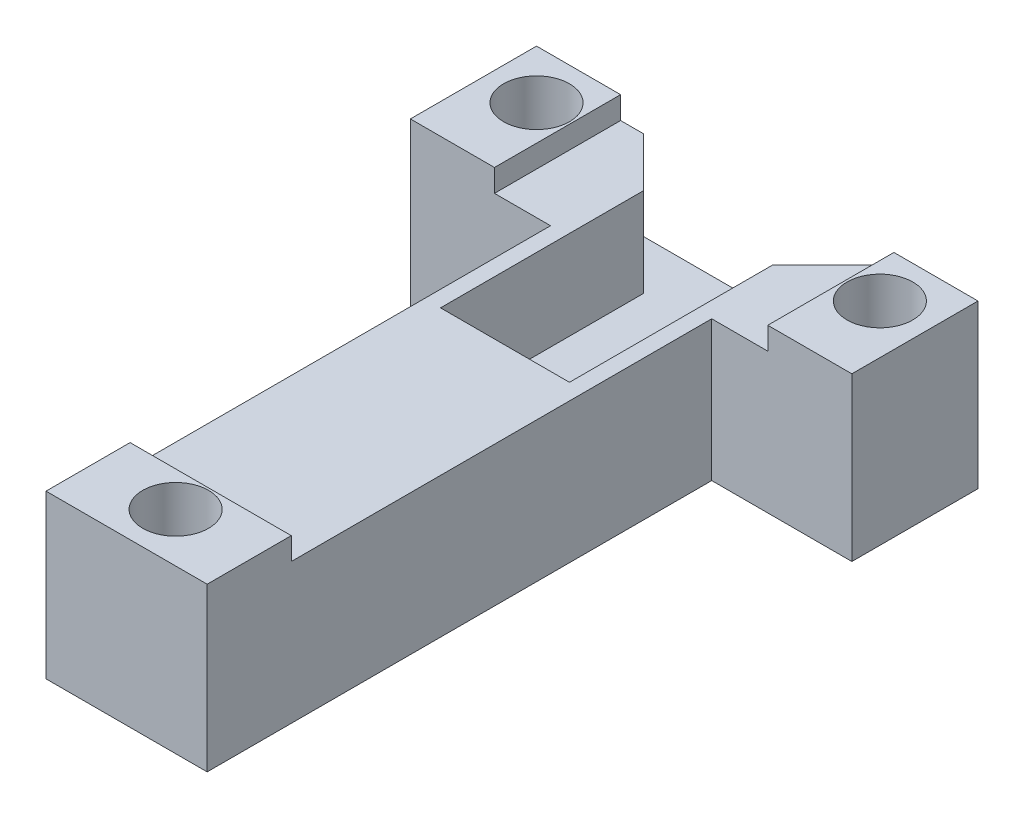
from build123d import *

# Parameters (mm, degrees)
BOSS_EXTRUDE1_DEPTH = 10
SKETCH2_R           = 2.3495
CUT_EXTRUDE1_DEPTH  = 6.35
SKETCH3_R           = 2.3495
CUT_EXTRUDE2_DEPTH  = 6.35
BOSS_EXTRUDE2_START = 1.6
SKETCH4_W           = 6
SKETCH4_H           = 9
SKETCH4_R           = 2.3495
SKETCH4_W_2         = 11.5
SKETCH4_H_2         = 6
BOSS_EXTRUDE2_DEPTH = 1.6


with BuildPart() as part:
    # Sketch1 → Boss-Extrude1 (new body)
    with BuildSketch(Plane(origin=(0, 0, 0), x_dir=(1, 0, 0), z_dir=(0, 1, 0))):
        Polygon((11.5, 0), (11.5, 36), (21.5, 36), (21.5, 45), (-10, 45), (-10, 36), (0, 36), (0, 0), align=None)
    extrude(amount=BOSS_EXTRUDE1_DEPTH)

    # Sketch2 → Cut-Extrude1 (cut)
    with BuildSketch(Plane(origin=(0, 10, 0), x_dir=(1, 0, 0), z_dir=(0, 1, 0))):
        Polygon((1.15, 41.5), (1.15, 27), (5.75, 27), (10.35, 27), (10.35, 41.5), (13.85, 45), (-2.35, 45), align=None)
        with Locations(Location((5.75, 3.5, 0), (0, 0, 270))):
            Circle(SKETCH2_R)
        with Locations(Location((-6.5, 41.5, 0), (0, 0, 270))):
            Circle(SKETCH2_R)
        with Locations(Location((18, 41.5, 0), (0, 0, 270))):
            Circle(SKETCH2_R)
    extrude(amount=-CUT_EXTRUDE1_DEPTH, mode=Mode.SUBTRACT)

    # Sketch3 → Cut-Extrude2 (cut)
    with BuildSketch(Plane.XZ):
        with Locations(Location((5.75, -10, 0), (0, 0, 270))):
            Circle(SKETCH3_R)
        with Locations(Location((5.75, -22, 0), (0, 0, 270))):
            Circle(SKETCH3_R)
    extrude(amount=-CUT_EXTRUDE2_DEPTH, mode=Mode.SUBTRACT)

    # Sketch4 → Boss-Extrude2 (add)
    # profile 1 of 3: a face of its own
    with BuildSketch(Plane(origin=(0, 10, 0), x_dir=(1, 0, 0), z_dir=(0, 1, 0)).offset(BOSS_EXTRUDE2_START)):
        with Locations((-7, 40.5)):
            Rectangle(SKETCH4_W, SKETCH4_H)
        with Locations(Location((-6.5, 41.5, 0), (0, 0, 270))):
            Circle(SKETCH4_R, mode=Mode.SUBTRACT)
    # profile 2 of 3: a face of its own
    with BuildSketch(Plane(origin=(0, 10, 0), x_dir=(1, 0, 0), z_dir=(0, 1, 0)).offset(BOSS_EXTRUDE2_START)):
        with Locations((18.5, 40.5)):
            Rectangle(SKETCH4_W, SKETCH4_H)
        with Locations(Location((18, 41.5, 0), (0, 0, 270))):
            Circle(SKETCH4_R, mode=Mode.SUBTRACT)
    # profile 3 of 3: a face of its own
    with BuildSketch(Plane(origin=(0, 10, 0), x_dir=(1, 0, 0), z_dir=(0, 1, 0)).offset(BOSS_EXTRUDE2_START)):
        with Locations((5.75, 3)):
            Rectangle(SKETCH4_W_2, SKETCH4_H_2)
        with Locations(Location((5.75, 3.5, 0), (0, 0, 270))):
            Circle(SKETCH4_R, mode=Mode.SUBTRACT)
    extrude(amount=-BOSS_EXTRUDE2_DEPTH)


solid = part.part
